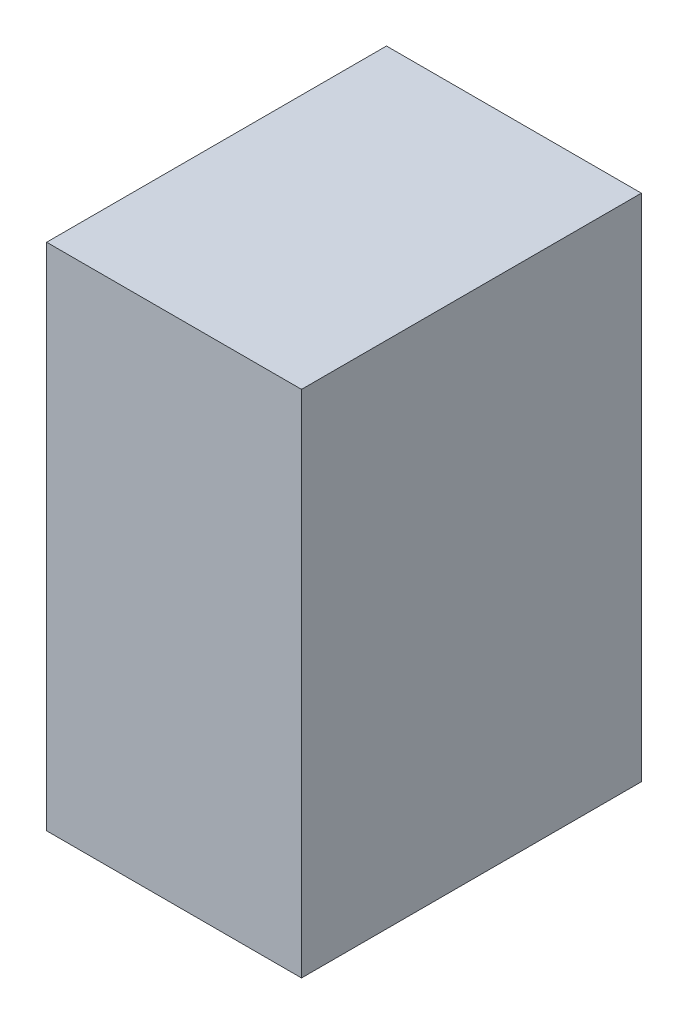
ISO-10303-21;
HEADER;
FILE_DESCRIPTION(('STEP AP214'),'2;1');
FILE_NAME('part.step','',(''),(''),'','','');
FILE_SCHEMA(('AUTOMOTIVE_DESIGN { 1 0 10303 214 1 1 1 1 }'));
ENDSEC;
DATA;
#1=APPLICATION_CONTEXT('core data for automotive mechanical design processes');
#2=APPLICATION_PROTOCOL_DEFINITION('international standard','automotive_design',2000,#1);
#3=PRODUCT_CONTEXT('',#1,'mechanical');
#4=PRODUCT('Part','Part','',(#3));
#5=PRODUCT_RELATED_PRODUCT_CATEGORY('part','',(#4));
#6=PRODUCT_DEFINITION_FORMATION('','',#4);
#7=PRODUCT_DEFINITION_CONTEXT('part definition',#1,'design');
#8=PRODUCT_DEFINITION('design','',#6,#7);
#9=PRODUCT_DEFINITION_SHAPE('','',#8);
#10=(LENGTH_UNIT() NAMED_UNIT(*) SI_UNIT(.MILLI.,.METRE.));
#11=(NAMED_UNIT(*) PLANE_ANGLE_UNIT() SI_UNIT($,.RADIAN.));
#12=(NAMED_UNIT(*) SI_UNIT($,.STERADIAN.) SOLID_ANGLE_UNIT());
#13=UNCERTAINTY_MEASURE_WITH_UNIT(LENGTH_MEASURE(1.E-05),#10,'distance_accuracy_value','');
#14=(GEOMETRIC_REPRESENTATION_CONTEXT(3) GLOBAL_UNCERTAINTY_ASSIGNED_CONTEXT((#13)) GLOBAL_UNIT_ASSIGNED_CONTEXT((#10,
#11,#12)) REPRESENTATION_CONTEXT('',''));
#15=CARTESIAN_POINT('',(0.,0.,0.));
#16=DIRECTION('',(0.,0.,1.));
#17=DIRECTION('',(1.,0.,0.));
#18=AXIS2_PLACEMENT_3D('',#15,#16,#17);
#19=CARTESIAN_POINT('',(-37.5,150.,-50.));
#20=DIRECTION('',(1.,0.,0.));
#21=DIRECTION('',(0.,0.,-1.));
#22=AXIS2_PLACEMENT_3D('',#19,#20,#21);
#23=PLANE('',#22);
#24=DIRECTION('',(0.,0.,1.));
#25=VECTOR('',#24,1.);
#26=CARTESIAN_POINT('',(-37.5,0.,-50.));
#27=LINE('',#26,#25);
#28=CARTESIAN_POINT('',(-37.5,0.,-50.));
#29=VERTEX_POINT('',#28);
#30=CARTESIAN_POINT('',(-37.5,0.,50.));
#31=VERTEX_POINT('',#30);
#32=EDGE_CURVE('E99',#29,#31,#27,.T.);
#33=ORIENTED_EDGE('',*,*,#32,.T.);
#34=DIRECTION('',(0.,-1.,0.));
#35=VECTOR('',#34,1.);
#36=CARTESIAN_POINT('',(-37.5,150.,50.));
#37=LINE('',#36,#35);
#38=CARTESIAN_POINT('',(-37.5,150.,50.));
#39=VERTEX_POINT('',#38);
#40=EDGE_CURVE('E11',#39,#31,#37,.T.);
#41=ORIENTED_EDGE('',*,*,#40,.F.);
#42=DIRECTION('',(0.,0.,1.));
#43=VECTOR('',#42,1.);
#44=CARTESIAN_POINT('',(-37.5,150.,-50.));
#45=LINE('',#44,#43);
#46=CARTESIAN_POINT('',(-37.5,150.,-50.));
#47=VERTEX_POINT('',#46);
#48=EDGE_CURVE('E87',#47,#39,#45,.T.);
#49=ORIENTED_EDGE('',*,*,#48,.F.);
#50=DIRECTION('',(0.,-1.,0.));
#51=VECTOR('',#50,1.);
#52=CARTESIAN_POINT('',(-37.5,150.,-50.));
#53=LINE('',#52,#51);
#54=EDGE_CURVE('E95',#47,#29,#53,.T.);
#55=ORIENTED_EDGE('',*,*,#54,.T.);
#56=EDGE_LOOP('',(#33,#41,#49,#55));
#57=FACE_BOUND('',#56,.T.);
#58=ADVANCED_FACE('F36',(#57),#23,.F.);
#59=CARTESIAN_POINT('',(-37.5,150.,50.));
#60=DIRECTION('',(0.,0.,-1.));
#61=DIRECTION('',(-1.,0.,0.));
#62=AXIS2_PLACEMENT_3D('',#59,#60,#61);
#63=PLANE('',#62);
#64=DIRECTION('',(1.,0.,0.));
#65=VECTOR('',#64,1.);
#66=CARTESIAN_POINT('',(-37.5,0.,50.));
#67=LINE('',#66,#65);
#68=CARTESIAN_POINT('',(37.5,0.,50.));
#69=VERTEX_POINT('',#68);
#70=EDGE_CURVE('E91',#31,#69,#67,.T.);
#71=ORIENTED_EDGE('',*,*,#70,.T.);
#72=DIRECTION('',(0.,-1.,0.));
#73=VECTOR('',#72,1.);
#74=CARTESIAN_POINT('',(37.5,150.,50.));
#75=LINE('',#74,#73);
#76=CARTESIAN_POINT('',(37.5,150.,50.));
#77=VERTEX_POINT('',#76);
#78=EDGE_CURVE('E44',#77,#69,#75,.T.);
#79=ORIENTED_EDGE('',*,*,#78,.F.);
#80=DIRECTION('',(1.,0.,0.));
#81=VECTOR('',#80,1.);
#82=CARTESIAN_POINT('',(-37.5,150.,50.));
#83=LINE('',#82,#81);
#84=EDGE_CURVE('E82',#39,#77,#83,.T.);
#85=ORIENTED_EDGE('',*,*,#84,.F.);
#86=ORIENTED_EDGE('',*,*,#40,.T.);
#87=EDGE_LOOP('',(#71,#79,#85,#86));
#88=FACE_BOUND('',#87,.T.);
#89=ADVANCED_FACE('F90',(#88),#63,.F.);
#90=CARTESIAN_POINT('',(37.5,150.,-50.));
#91=DIRECTION('',(-1.,0.,0.));
#92=DIRECTION('',(0.,0.,1.));
#93=AXIS2_PLACEMENT_3D('',#90,#91,#92);
#94=PLANE('',#93);
#95=DIRECTION('',(0.,0.,-1.));
#96=VECTOR('',#95,1.);
#97=CARTESIAN_POINT('',(37.5,0.,-50.));
#98=LINE('',#97,#96);
#99=CARTESIAN_POINT('',(37.5,0.,-50.));
#100=VERTEX_POINT('',#99);
#101=EDGE_CURVE('E69',#69,#100,#98,.T.);
#102=ORIENTED_EDGE('',*,*,#101,.T.);
#103=DIRECTION('',(0.,-1.,0.));
#104=VECTOR('',#103,1.);
#105=CARTESIAN_POINT('',(37.5,150.,-50.));
#106=LINE('',#105,#104);
#107=CARTESIAN_POINT('',(37.5,150.,-50.));
#108=VERTEX_POINT('',#107);
#109=EDGE_CURVE('E92',#108,#100,#106,.T.);
#110=ORIENTED_EDGE('',*,*,#109,.F.);
#111=DIRECTION('',(0.,0.,-1.));
#112=VECTOR('',#111,1.);
#113=CARTESIAN_POINT('',(37.5,150.,-50.));
#114=LINE('',#113,#112);
#115=EDGE_CURVE('E85',#77,#108,#114,.T.);
#116=ORIENTED_EDGE('',*,*,#115,.F.);
#117=ORIENTED_EDGE('',*,*,#78,.T.);
#118=EDGE_LOOP('',(#102,#110,#116,#117));
#119=FACE_BOUND('',#118,.T.);
#120=ADVANCED_FACE('F93',(#119),#94,.F.);
#121=CARTESIAN_POINT('',(-37.5,150.,-50.));
#122=DIRECTION('',(0.,0.,1.));
#123=DIRECTION('',(1.,0.,0.));
#124=AXIS2_PLACEMENT_3D('',#121,#122,#123);
#125=PLANE('',#124);
#126=DIRECTION('',(-1.,0.,0.));
#127=VECTOR('',#126,1.);
#128=CARTESIAN_POINT('',(-37.5,0.,-50.));
#129=LINE('',#128,#127);
#130=EDGE_CURVE('E75',#100,#29,#129,.T.);
#131=ORIENTED_EDGE('',*,*,#130,.T.);
#132=ORIENTED_EDGE('',*,*,#54,.F.);
#133=DIRECTION('',(-1.,0.,0.));
#134=VECTOR('',#133,1.);
#135=CARTESIAN_POINT('',(-37.5,150.,-50.));
#136=LINE('',#135,#134);
#137=EDGE_CURVE('E52',#108,#47,#136,.T.);
#138=ORIENTED_EDGE('',*,*,#137,.F.);
#139=ORIENTED_EDGE('',*,*,#109,.T.);
#140=EDGE_LOOP('',(#131,#132,#138,#139));
#141=FACE_BOUND('',#140,.T.);
#142=ADVANCED_FACE('F106',(#141),#125,.F.);
#143=CARTESIAN_POINT('',(-37.5,150.,50.));
#144=DIRECTION('',(0.,1.,0.));
#145=DIRECTION('',(0.,0.,1.));
#146=AXIS2_PLACEMENT_3D('',#143,#144,#145);
#147=PLANE('',#146);
#148=ORIENTED_EDGE('',*,*,#48,.T.);
#149=ORIENTED_EDGE('',*,*,#84,.T.);
#150=ORIENTED_EDGE('',*,*,#115,.T.);
#151=ORIENTED_EDGE('',*,*,#137,.T.);
#152=EDGE_LOOP('',(#148,#149,#150,#151));
#153=FACE_BOUND('',#152,.T.);
#154=ADVANCED_FACE('F83',(#153),#147,.T.);
#155=CARTESIAN_POINT('',(-37.5,0.,50.));
#156=DIRECTION('',(0.,1.,0.));
#157=DIRECTION('',(0.,0.,1.));
#158=AXIS2_PLACEMENT_3D('',#155,#156,#157);
#159=PLANE('',#158);
#160=ORIENTED_EDGE('',*,*,#32,.F.);
#161=ORIENTED_EDGE('',*,*,#130,.F.);
#162=ORIENTED_EDGE('',*,*,#101,.F.);
#163=ORIENTED_EDGE('',*,*,#70,.F.);
#164=EDGE_LOOP('',(#160,#161,#162,#163));
#165=FACE_BOUND('',#164,.T.);
#166=ADVANCED_FACE('F109',(#165),#159,.F.);
#167=CLOSED_SHELL('',(#58,#89,#120,#142,#154,#166));
#168=MANIFOLD_SOLID_BREP('B2',#167);
#169=ADVANCED_BREP_SHAPE_REPRESENTATION('',(#18,#168),#14);
#170=SHAPE_DEFINITION_REPRESENTATION(#9,#169);
ENDSEC;
END-ISO-10303-21;
